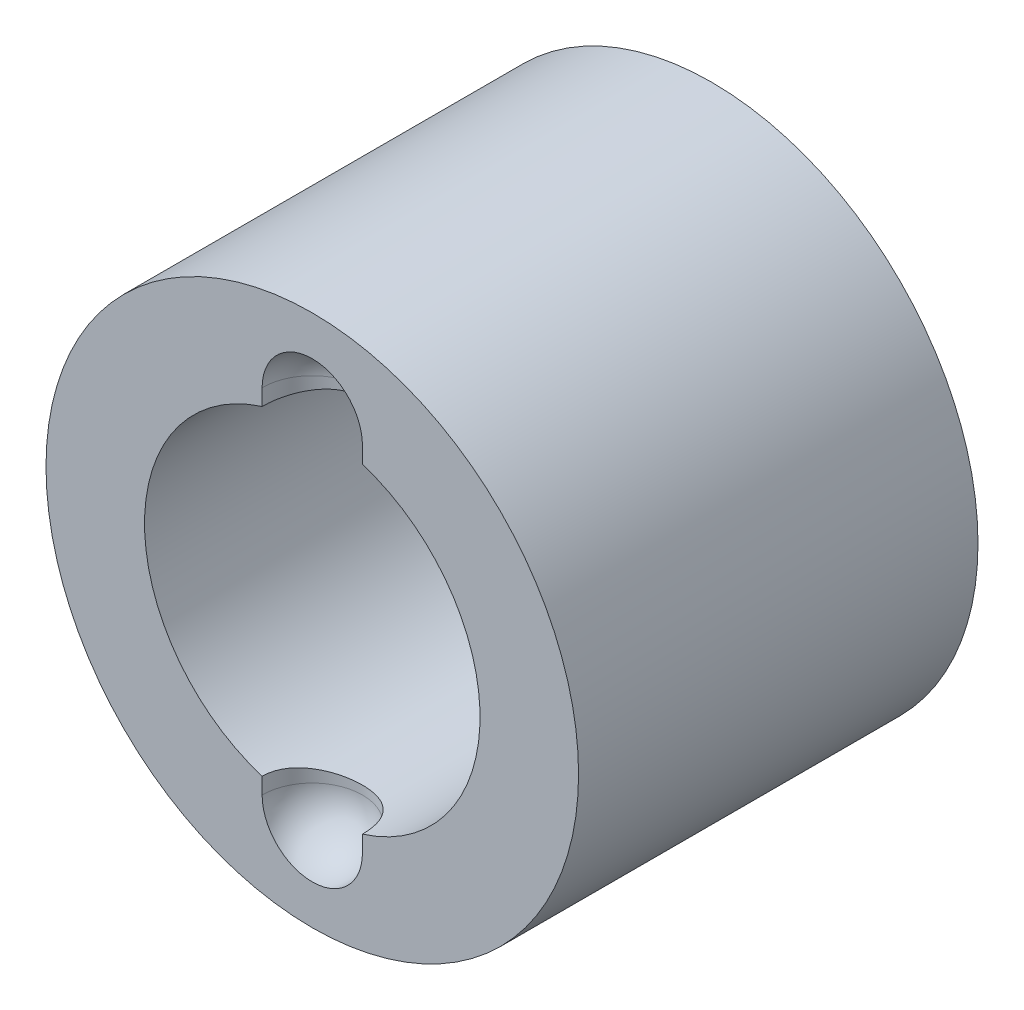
from build123d import *

# Parameters (mm, degrees)
SKETCH1_R          = 12.7
SKETCH1_R_2        = 8.001
BASE_EXTRUDE_DEPTH = 19.05
CUT_REVOLVE1_ANGLE = 180


with BuildPart() as part:
    # Sketch1 → Base-Extrude (new body)
    with BuildSketch(Plane.XY):
        with Locations(Location((0, 0, 0), (0, 0, 180))):
            Circle(SKETCH1_R)
        with Locations(Location((0, 0, 0), (0, 0, 252.59920329))):
            Circle(SKETCH1_R_2, mode=Mode.SUBTRACT)
    extrude(amount=BASE_EXTRUDE_DEPTH)

    # Sketch2 → Cut-Revolve1 (revolve, cut)
    with BuildSketch(Plane.XY.offset(19.05)):
        with BuildLine():
            Line((2.392731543, 8.412054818), (2.392731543, -8.412054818))
            ThreePointArc((2.392731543, -8.412054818), (1.691952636, -10.10418103), (0, -10.805378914))
            Line((0, -10.805378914), (0, 10.805378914))
            ThreePointArc((0, 10.805378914), (1.691952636, 10.10418103), (2.392731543, 8.412054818))
        make_face()
    revolve(axis=Axis((0, 0, 19.05), (0, 1, 0)), revolution_arc=CUT_REVOLVE1_ANGLE, mode=Mode.SUBTRACT)


solid = part.part
